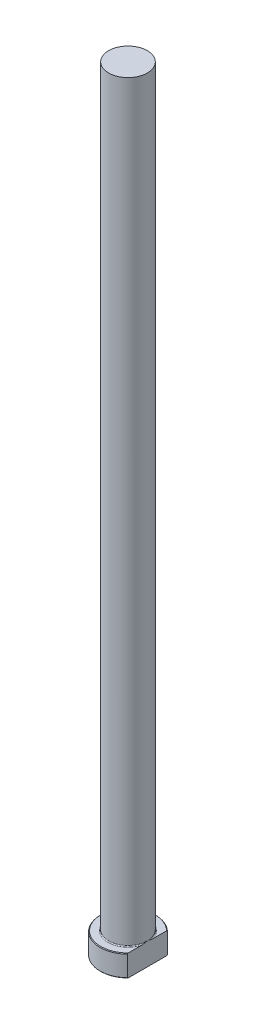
ISO-10303-21;
HEADER;
FILE_DESCRIPTION(('STEP AP214'),'2;1');
FILE_NAME('part.step','',(''),(''),'','','');
FILE_SCHEMA(('AUTOMOTIVE_DESIGN { 1 0 10303 214 1 1 1 1 }'));
ENDSEC;
DATA;
#1=APPLICATION_CONTEXT('core data for automotive mechanical design processes');
#2=APPLICATION_PROTOCOL_DEFINITION('international standard','automotive_design',2000,#1);
#3=PRODUCT_CONTEXT('',#1,'mechanical');
#4=PRODUCT('Part','Part','',(#3));
#5=PRODUCT_RELATED_PRODUCT_CATEGORY('part','',(#4));
#6=PRODUCT_DEFINITION_FORMATION('','',#4);
#7=PRODUCT_DEFINITION_CONTEXT('part definition',#1,'design');
#8=PRODUCT_DEFINITION('design','',#6,#7);
#9=PRODUCT_DEFINITION_SHAPE('','',#8);
#10=(LENGTH_UNIT() NAMED_UNIT(*) SI_UNIT(.MILLI.,.METRE.));
#11=(NAMED_UNIT(*) PLANE_ANGLE_UNIT() SI_UNIT($,.RADIAN.));
#12=(NAMED_UNIT(*) SI_UNIT($,.STERADIAN.) SOLID_ANGLE_UNIT());
#13=UNCERTAINTY_MEASURE_WITH_UNIT(LENGTH_MEASURE(1.E-05),#10,'distance_accuracy_value','');
#14=(GEOMETRIC_REPRESENTATION_CONTEXT(3) GLOBAL_UNCERTAINTY_ASSIGNED_CONTEXT((#13)) GLOBAL_UNIT_ASSIGNED_CONTEXT((#10,
#11,#12)) REPRESENTATION_CONTEXT('',''));
#15=CARTESIAN_POINT('',(0.,0.,0.));
#16=DIRECTION('',(0.,0.,1.));
#17=DIRECTION('',(1.,0.,0.));
#18=AXIS2_PLACEMENT_3D('',#15,#16,#17);
#19=CARTESIAN_POINT('',(0.,0.,0.));
#20=DIRECTION('',(0.,-1.,0.));
#21=DIRECTION('',(0.,0.,-1.));
#22=AXIS2_PLACEMENT_3D('',#19,#20,#21);
#23=PLANE('',#22);
#24=CARTESIAN_POINT('',(0.,0.,0.));
#25=DIRECTION('',(0.,-1.,0.));
#26=DIRECTION('',(0.,0.,-1.));
#27=AXIS2_PLACEMENT_3D('',#24,#25,#26);
#28=CIRCLE('',#27,8.79999999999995);
#29=CARTESIAN_POINT('',(6.24999999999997,0.,6.19495762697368));
#30=VERTEX_POINT('',#29);
#31=CARTESIAN_POINT('',(6.24999999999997,0.,-6.19495762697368));
#32=VERTEX_POINT('',#31);
#33=EDGE_CURVE('E98',#30,#32,#28,.T.);
#34=ORIENTED_EDGE('',*,*,#33,.T.);
#35=DIRECTION('',(0.,0.,1.));
#36=VECTOR('',#35,1.);
#37=CARTESIAN_POINT('',(6.24999999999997,0.,-6.47591692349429));
#38=LINE('',#37,#36);
#39=EDGE_CURVE('E83',#32,#30,#38,.T.);
#40=ORIENTED_EDGE('',*,*,#39,.T.);
#41=EDGE_LOOP('',(#34,#40));
#42=FACE_BOUND('',#41,.T.);
#43=ADVANCED_FACE('F32',(#42),#23,.T.);
#44=CARTESIAN_POINT('',(0.,259.958771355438,0.));
#45=DIRECTION('',(0.,1.,0.));
#46=DIRECTION('',(0.,0.,1.));
#47=AXIS2_PLACEMENT_3D('',#44,#45,#46);
#48=CYLINDRICAL_SURFACE('',#47,8.99999999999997);
#49=CARTESIAN_POINT('',(0.,6.79999999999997,0.));
#50=DIRECTION('',(0.,1.,0.));
#51=DIRECTION('',(0.,0.,1.));
#52=AXIS2_PLACEMENT_3D('',#49,#50,#51);
#53=CIRCLE('',#52,8.99999999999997);
#54=CARTESIAN_POINT('',(6.24999999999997,6.79999999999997,6.47591692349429));
#55=VERTEX_POINT('',#54);
#56=CARTESIAN_POINT('',(6.24999999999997,6.79999999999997,-6.47591692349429));
#57=VERTEX_POINT('',#56);
#58=EDGE_CURVE('E104',#55,#57,#53,.F.);
#59=ORIENTED_EDGE('',*,*,#58,.T.);
#60=DIRECTION('',(0.,-1.,0.));
#61=VECTOR('',#60,1.);
#62=CARTESIAN_POINT('',(6.24999999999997,250.,-6.47591692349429));
#63=LINE('',#62,#61);
#64=CARTESIAN_POINT('',(6.24999999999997,0.200000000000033,-6.47591692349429));
#65=VERTEX_POINT('',#64);
#66=EDGE_CURVE('E183',#57,#65,#63,.T.);
#67=ORIENTED_EDGE('',*,*,#66,.T.);
#68=CARTESIAN_POINT('',(0.,0.200000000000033,0.));
#69=DIRECTION('',(0.,-1.,0.));
#70=DIRECTION('',(0.,0.,-1.));
#71=AXIS2_PLACEMENT_3D('',#68,#69,#70);
#72=CIRCLE('',#71,8.99999999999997);
#73=CARTESIAN_POINT('',(6.24999999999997,0.200000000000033,6.47591692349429));
#74=VERTEX_POINT('',#73);
#75=EDGE_CURVE('E100',#65,#74,#72,.F.);
#76=ORIENTED_EDGE('',*,*,#75,.T.);
#77=DIRECTION('',(0.,-1.,0.));
#78=VECTOR('',#77,1.);
#79=CARTESIAN_POINT('',(6.24999999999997,250.,6.47591692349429));
#80=LINE('',#79,#78);
#81=EDGE_CURVE('E93',#55,#74,#80,.T.);
#82=ORIENTED_EDGE('',*,*,#81,.F.);
#83=EDGE_LOOP('',(#59,#67,#76,#82));
#84=FACE_BOUND('',#83,.T.);
#85=ADVANCED_FACE('F158',(#84),#48,.T.);
#86=CARTESIAN_POINT('',(-8.99999999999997,7.,0.));
#87=DIRECTION('',(0.,1.,0.));
#88=DIRECTION('',(0.,0.,1.));
#89=AXIS2_PLACEMENT_3D('',#86,#87,#88);
#90=PLANE('',#89);
#91=CARTESIAN_POINT('',(0.,7.,0.));
#92=DIRECTION('',(0.,1.,0.));
#93=DIRECTION('',(0.,0.,1.));
#94=AXIS2_PLACEMENT_3D('',#91,#92,#93);
#95=CIRCLE('',#94,8.79999999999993);
#96=CARTESIAN_POINT('',(6.24999999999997,7.,-6.19495762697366));
#97=VERTEX_POINT('',#96);
#98=CARTESIAN_POINT('',(6.24999999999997,7.,6.19495762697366));
#99=VERTEX_POINT('',#98);
#100=EDGE_CURVE('E178',#97,#99,#95,.T.);
#101=ORIENTED_EDGE('',*,*,#100,.T.);
#102=DIRECTION('',(0.,0.,-1.));
#103=VECTOR('',#102,1.);
#104=CARTESIAN_POINT('',(6.24999999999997,7.,0.));
#105=LINE('',#104,#103);
#106=CARTESIAN_POINT('',(6.24999999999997,6.99999999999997,1.95959179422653));
#107=VERTEX_POINT('',#106);
#108=EDGE_CURVE('E57',#99,#107,#105,.T.);
#109=ORIENTED_EDGE('',*,*,#108,.T.);
#110=CARTESIAN_POINT('',(0.,7.,0.));
#111=DIRECTION('',(0.,1.,0.));
#112=DIRECTION('',(0.,0.,1.));
#113=AXIS2_PLACEMENT_3D('',#110,#111,#112);
#114=CIRCLE('',#113,6.54999999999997);
#115=CARTESIAN_POINT('',(6.24999999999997,6.99999999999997,-1.95959179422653));
#116=VERTEX_POINT('',#115);
#117=EDGE_CURVE('E107',#107,#116,#114,.F.);
#118=ORIENTED_EDGE('',*,*,#117,.T.);
#119=EDGE_CURVE('E136',#116,#97,#105,.T.);
#120=ORIENTED_EDGE('',*,*,#119,.T.);
#121=EDGE_LOOP('',(#101,#109,#118,#120));
#122=FACE_BOUND('',#121,.T.);
#123=ADVANCED_FACE('F147',(#122),#90,.T.);
#124=CARTESIAN_POINT('',(0.,7.00000000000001,0.));
#125=DIRECTION('',(0.,-1.,0.));
#126=DIRECTION('',(0.,0.,-1.));
#127=AXIS2_PLACEMENT_3D('',#124,#125,#126);
#128=CONICAL_SURFACE('',#127,8.79999999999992,0.785398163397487);
#129=ORIENTED_EDGE('',*,*,#58,.F.);
#130=CARTESIAN_POINT('',(6.24999999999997,0.241333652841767,14.2481436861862));
#131=CARTESIAN_POINT('',(6.24999999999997,0.433510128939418,14.0382871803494));
#132=CARTESIAN_POINT('',(6.24999999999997,0.62531824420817,13.8280934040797));
#133=CARTESIAN_POINT('',(6.24999999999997,1.00808847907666,13.4069339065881));
#134=CARTESIAN_POINT('',(6.24999999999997,1.19905059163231,13.1959681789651));
#135=CARTESIAN_POINT('',(6.24999999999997,1.77058893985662,12.5616726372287));
#136=CARTESIAN_POINT('',(6.24999999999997,2.1497265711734,12.1370432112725));
#137=CARTESIAN_POINT('',(6.24999999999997,2.9054474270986,11.2804244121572));
#138=CARTESIAN_POINT('',(6.24999999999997,3.2819964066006,10.8484047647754));
#139=CARTESIAN_POINT('',(6.24999999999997,4.02800319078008,9.97835973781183));
#140=CARTESIAN_POINT('',(6.24999999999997,4.39746188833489,9.5403351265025));
#141=CARTESIAN_POINT('',(6.24999999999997,5.06619556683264,8.72902037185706));
#142=CARTESIAN_POINT('',(6.24999999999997,5.36698522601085,8.35698524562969));
#143=CARTESIAN_POINT('',(6.24999999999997,5.81091107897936,7.79312105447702));
#144=CARTESIAN_POINT('',(6.24999999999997,5.95769918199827,7.60416746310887));
#145=CARTESIAN_POINT('',(6.24999999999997,6.24834991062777,7.22402635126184));
#146=CARTESIAN_POINT('',(6.24999999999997,6.392212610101,7.03283888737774));
#147=CARTESIAN_POINT('',(6.24999999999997,6.67624882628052,6.64809388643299));
#148=CARTESIAN_POINT('',(6.24999999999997,6.81642658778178,6.45453948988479));
#149=CARTESIAN_POINT('',(6.24999999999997,7.09250069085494,6.06440831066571));
#150=CARTESIAN_POINT('',(6.24999999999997,7.2283972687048,5.86783169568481));
#151=CARTESIAN_POINT('',(6.24999999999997,7.49487226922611,5.47121725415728));
#152=CARTESIAN_POINT('',(6.24999999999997,7.62545297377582,5.27118096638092));
#153=CARTESIAN_POINT('',(6.24999999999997,7.88005759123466,4.86699392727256));
#154=CARTESIAN_POINT('',(6.24999999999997,8.00408234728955,4.66284370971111));
#155=CARTESIAN_POINT('',(6.24999999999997,8.24192682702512,4.25315549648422));
#156=CARTESIAN_POINT('',(6.24999999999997,8.35588135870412,4.04769623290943));
#157=CARTESIAN_POINT('',(6.24999999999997,8.57376120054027,3.63145654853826));
#158=CARTESIAN_POINT('',(6.24999999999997,8.67768550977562,3.42067559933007));
#159=CARTESIAN_POINT('',(6.24999999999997,8.87268822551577,2.99352725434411));
#160=CARTESIAN_POINT('',(6.24999999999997,8.96378316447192,2.77716748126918));
#161=CARTESIAN_POINT('',(6.24999999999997,9.12997532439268,2.33835397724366));
#162=CARTESIAN_POINT('',(6.24999999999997,9.20507709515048,2.11590199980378));
#163=CARTESIAN_POINT('',(6.24999999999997,9.32245998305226,1.71047588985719));
#164=CARTESIAN_POINT('',(6.24999999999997,9.36830307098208,1.52853906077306));
#165=CARTESIAN_POINT('',(6.24999999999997,9.44550018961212,1.16159607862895));
#166=CARTESIAN_POINT('',(6.24999999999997,9.47685624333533,0.976590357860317));
#167=CARTESIAN_POINT('',(6.24999999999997,9.52348341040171,0.605004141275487));
#168=CARTESIAN_POINT('',(6.24999999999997,9.53879458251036,0.418428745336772));
#169=CARTESIAN_POINT('',(6.24999999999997,9.55263073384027,0.0446485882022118));
#170=CARTESIAN_POINT('',(6.24999999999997,9.55115595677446,-0.142556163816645));
#171=CARTESIAN_POINT('',(6.24999999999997,9.53151010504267,-0.515964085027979));
#172=CARTESIAN_POINT('',(6.24999999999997,9.51334871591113,-0.702167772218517));
#173=CARTESIAN_POINT('',(6.24999999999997,9.46132296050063,-1.07235055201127));
#174=CARTESIAN_POINT('',(6.24999999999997,9.42745724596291,-1.2563294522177));
#175=CARTESIAN_POINT('',(6.24999999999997,9.34551825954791,-1.62161387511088));
#176=CARTESIAN_POINT('',(6.24999999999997,9.29740414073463,-1.80291011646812));
#177=CARTESIAN_POINT('',(6.24999999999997,9.18891949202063,-2.16174722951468));
#178=CARTESIAN_POINT('',(6.24999999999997,9.12854919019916,-2.3392881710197));
#179=CARTESIAN_POINT('',(6.24999999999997,8.98038960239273,-2.73619642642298));
#180=CARTESIAN_POINT('',(6.24999999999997,8.88955370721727,-2.95442044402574));
#181=CARTESIAN_POINT('',(6.24999999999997,8.69480317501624,-3.38500003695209));
#182=CARTESIAN_POINT('',(6.24999999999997,8.59088203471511,-3.59735262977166));
#183=CARTESIAN_POINT('',(6.24999999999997,8.37253952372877,-4.01706977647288));
#184=CARTESIAN_POINT('',(6.24999999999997,8.2580982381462,-4.22442389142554));
#185=CARTESIAN_POINT('',(6.24999999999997,8.02107167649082,-4.63434772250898));
#186=CARTESIAN_POINT('',(6.24999999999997,7.89848770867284,-4.83691820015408));
#187=CARTESIAN_POINT('',(6.24999999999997,7.64548625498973,-5.24008406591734));
#188=CARTESIAN_POINT('',(6.24999999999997,7.51499955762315,-5.44063581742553));
#189=CARTESIAN_POINT('',(6.24999999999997,7.24868510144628,-5.83817237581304));
#190=CARTESIAN_POINT('',(6.24999999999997,7.11285688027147,-6.03515687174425));
#191=CARTESIAN_POINT('',(6.24999999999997,6.83683288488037,-6.42612120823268));
#192=CARTESIAN_POINT('',(6.24999999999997,6.69663581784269,-6.62010013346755));
#193=CARTESIAN_POINT('',(6.24999999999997,6.41268260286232,-7.00543858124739));
#194=CARTESIAN_POINT('',(6.24999999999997,6.26892633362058,-7.19679801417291));
#195=CARTESIAN_POINT('',(6.24999999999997,5.89056224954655,-7.6924294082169));
#196=CARTESIAN_POINT('',(6.24999999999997,5.65363599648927,-7.99493062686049));
#197=CARTESIAN_POINT('',(6.24999999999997,5.17412949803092,-8.59529922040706));
#198=CARTESIAN_POINT('',(6.24999999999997,4.9315503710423,-8.89316749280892));
#199=CARTESIAN_POINT('',(6.24999999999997,4.44181409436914,-9.48544309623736));
#200=CARTESIAN_POINT('',(6.24999999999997,4.19465400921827,-9.77984799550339));
#201=CARTESIAN_POINT('',(6.24999999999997,3.6968379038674,-10.3657062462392));
#202=CARTESIAN_POINT('',(6.24999999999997,3.44618171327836,-10.6571594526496));
#203=CARTESIAN_POINT('',(6.24999999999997,2.95199448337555,-11.2262122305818));
#204=CARTESIAN_POINT('',(6.24999999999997,2.70857128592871,-11.5039055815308));
#205=CARTESIAN_POINT('',(6.24999999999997,2.21961081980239,-12.0574158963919));
#206=CARTESIAN_POINT('',(6.24999999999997,1.97407358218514,-12.3332328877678));
#207=CARTESIAN_POINT('',(6.24999999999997,1.4815097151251,-12.8829958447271));
#208=CARTESIAN_POINT('',(6.24999999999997,1.23448497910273,-13.1569435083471));
#209=CARTESIAN_POINT('',(6.24999999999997,0.738953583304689,-13.7034947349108));
#210=CARTESIAN_POINT('',(6.24999999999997,0.490446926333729,-13.9760983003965));
#211=CARTESIAN_POINT('',(6.24999999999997,0.241333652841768,-14.2481436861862));
#212=B_SPLINE_CURVE_WITH_KNOTS('',3,(#130,#131,#132,#133,#134,#135,#136,#137,#138,#139,#140,
#141,#142,#143,#144,#145,#146,#147,#148,#149,#150,#151,#152,#153,#154,#155,#156,#157,#158,#159,
#160,#161,#162,#163,#164,#165,#166,#167,#168,#169,#170,#171,#172,#173,#174,#175,#176,#177,#178,
#179,#180,#181,#182,#183,#184,#185,#186,#187,#188,#189,#190,#191,#192,#193,#194,#195,#196,#197,
#198,#199,#200,#201,#202,#203,#204,#205,#206,#207,#208,#209,#210,#211),.UNSPECIFIED.,.F.,.F.,(4,
2,2,2,2,2,2,2,2,2,2,2,2,2,2,2,2,2,2,2,2,2,2,2,2,2,2,2,2,2,2,2,2,2,2,2,2,2,2,2,4),(0.,
0.853664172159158,1.70733543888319,3.41508002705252,5.13429133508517,6.85328470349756,
8.28840776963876,9.00619588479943,9.72396585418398,10.4408691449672,11.1577328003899,
11.8742854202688,12.5907456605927,13.2953619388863,14.0000484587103,14.7038184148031,
15.4073878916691,15.9697505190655,16.5320345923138,17.0929114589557,17.6537801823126,
18.2143235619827,18.7749150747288,19.3371294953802,19.8993334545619,20.6078926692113,
21.3168054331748,22.0270889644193,22.7372586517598,23.4549493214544,24.1727022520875,
24.8906696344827,25.608661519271,26.7612833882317,27.9136791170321,29.0668407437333,
30.220058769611,31.3278889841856,32.4357029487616,33.5423213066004,34.6489375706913),.UNSPECIFIED.);
#213=EDGE_CURVE('E135',#55,#99,#212,.T.);
#214=ORIENTED_EDGE('',*,*,#213,.T.);
#215=ORIENTED_EDGE('',*,*,#100,.F.);
#216=EDGE_CURVE('E127',#97,#57,#212,.T.);
#217=ORIENTED_EDGE('',*,*,#216,.T.);
#218=EDGE_LOOP('',(#129,#214,#215,#217));
#219=FACE_BOUND('',#218,.T.);
#220=ADVANCED_FACE('F143',(#219),#128,.T.);
#221=CARTESIAN_POINT('',(0.,0.200000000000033,0.));
#222=DIRECTION('',(0.,1.,0.));
#223=DIRECTION('',(0.,0.,1.));
#224=AXIS2_PLACEMENT_3D('',#221,#222,#223);
#225=CONICAL_SURFACE('',#224,8.99999999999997,0.785398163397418);
#226=ORIENTED_EDGE('',*,*,#75,.F.);
#227=CARTESIAN_POINT('',(6.24999999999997,6.75866634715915,-14.2481436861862));
#228=CARTESIAN_POINT('',(6.24999999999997,6.56648987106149,-14.0382871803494));
#229=CARTESIAN_POINT('',(6.24999999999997,6.37468175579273,-13.8280934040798));
#230=CARTESIAN_POINT('',(6.24999999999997,5.99191152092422,-13.4069339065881));
#231=CARTESIAN_POINT('',(6.24999999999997,5.80094940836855,-13.1959681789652));
#232=CARTESIAN_POINT('',(6.24999999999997,5.22941106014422,-12.5616726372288));
#233=CARTESIAN_POINT('',(6.24999999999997,4.85027342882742,-12.1370432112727));
#234=CARTESIAN_POINT('',(6.24999999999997,4.09455257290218,-11.2804244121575));
#235=CARTESIAN_POINT('',(6.24999999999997,3.71800359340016,-10.8484047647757));
#236=CARTESIAN_POINT('',(6.24999999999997,2.97199680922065,-9.97835973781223));
#237=CARTESIAN_POINT('',(6.24999999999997,2.60253811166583,-9.54033512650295));
#238=CARTESIAN_POINT('',(6.24999999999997,1.93380443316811,-8.72902037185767));
#239=CARTESIAN_POINT('',(6.24999999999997,1.63301477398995,-8.35698524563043));
#240=CARTESIAN_POINT('',(6.24999999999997,1.18908892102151,-7.79312105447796));
#241=CARTESIAN_POINT('',(6.24999999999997,1.04230081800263,-7.60416746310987));
#242=CARTESIAN_POINT('',(6.24999999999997,0.751650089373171,-7.22402635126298));
#243=CARTESIAN_POINT('',(6.24999999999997,0.607787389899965,-7.03283888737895));
#244=CARTESIAN_POINT('',(6.24999999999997,0.323751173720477,-6.64809388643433));
#245=CARTESIAN_POINT('',(6.24999999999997,0.183573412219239,-6.4545394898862));
#246=CARTESIAN_POINT('',(6.24999999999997,-0.0925006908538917,-6.06440831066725));
#247=CARTESIAN_POINT('',(6.24999999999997,-0.228397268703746,-5.86783169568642));
#248=CARTESIAN_POINT('',(6.24999999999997,-0.494872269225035,-5.47121725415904));
#249=CARTESIAN_POINT('',(6.24999999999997,-0.62545297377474,-5.27118096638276));
#250=CARTESIAN_POINT('',(6.24999999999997,-0.880057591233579,-4.86699392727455));
#251=CARTESIAN_POINT('',(6.24999999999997,-1.00408234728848,-4.66284370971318));
#252=CARTESIAN_POINT('',(6.24999999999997,-1.24192682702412,-4.25315549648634));
#253=CARTESIAN_POINT('',(6.24999999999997,-1.35588135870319,-4.04769623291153));
#254=CARTESIAN_POINT('',(6.24999999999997,-1.57376120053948,-3.63145654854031));
#255=CARTESIAN_POINT('',(6.24999999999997,-1.67768550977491,-3.42067559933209));
#256=CARTESIAN_POINT('',(6.24999999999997,-1.8726882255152,-2.99352725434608));
#257=CARTESIAN_POINT('',(6.24999999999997,-1.96378316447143,-2.77716748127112));
#258=CARTESIAN_POINT('',(6.24999999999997,-2.12997532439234,-2.33835397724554));
#259=CARTESIAN_POINT('',(6.24999999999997,-2.20507709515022,-2.11590199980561));
#260=CARTESIAN_POINT('',(6.24999999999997,-2.32245998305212,-1.71047588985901));
#261=CARTESIAN_POINT('',(6.24999999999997,-2.36830307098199,-1.5285390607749));
#262=CARTESIAN_POINT('',(6.24999999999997,-2.44550018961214,-1.16159607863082));
#263=CARTESIAN_POINT('',(6.24999999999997,-2.47685624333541,-0.976590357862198));
#264=CARTESIAN_POINT('',(6.24999999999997,-2.5234834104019,-0.605004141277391));
#265=CARTESIAN_POINT('',(6.24999999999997,-2.5387945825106,-0.418428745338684));
#266=CARTESIAN_POINT('',(6.24999999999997,-2.55263073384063,-0.0446485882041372));
#267=CARTESIAN_POINT('',(6.24999999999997,-2.55115595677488,0.142556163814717));
#268=CARTESIAN_POINT('',(6.24999999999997,-2.53151010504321,0.515964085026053));
#269=CARTESIAN_POINT('',(6.24999999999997,-2.51334871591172,0.702167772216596));
#270=CARTESIAN_POINT('',(6.24999999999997,-2.46132296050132,1.07235055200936));
#271=CARTESIAN_POINT('',(6.24999999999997,-2.42745724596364,1.2563294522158));
#272=CARTESIAN_POINT('',(6.24999999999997,-2.34551825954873,1.621613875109));
#273=CARTESIAN_POINT('',(6.24999999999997,-2.29740414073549,1.80291011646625));
#274=CARTESIAN_POINT('',(6.24999999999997,-2.18891949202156,2.16174722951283));
#275=CARTESIAN_POINT('',(6.24999999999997,-2.12854919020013,2.33928817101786));
#276=CARTESIAN_POINT('',(6.24999999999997,-1.98038960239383,2.73619642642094));
#277=CARTESIAN_POINT('',(6.24999999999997,-1.8895537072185,2.9544204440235));
#278=CARTESIAN_POINT('',(6.24999999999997,-1.69480317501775,3.38500003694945));
#279=CARTESIAN_POINT('',(6.24999999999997,-1.59088203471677,3.59735262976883));
#280=CARTESIAN_POINT('',(6.24999999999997,-1.37253952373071,4.01706977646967));
#281=CARTESIAN_POINT('',(6.24999999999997,-1.2580982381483,4.22442389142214));
#282=CARTESIAN_POINT('',(6.24999999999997,-1.02107167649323,4.6343477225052));
#283=CARTESIAN_POINT('',(6.24999999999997,-0.898487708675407,4.83691820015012));
#284=CARTESIAN_POINT('',(6.24999999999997,-0.645486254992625,5.24008406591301));
#285=CARTESIAN_POINT('',(6.24999999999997,-0.514999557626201,5.44063581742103));
#286=CARTESIAN_POINT('',(6.24999999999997,-0.248685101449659,5.83817237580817));
#287=CARTESIAN_POINT('',(6.24999999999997,-0.112856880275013,6.03515687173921));
#288=CARTESIAN_POINT('',(6.24999999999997,0.163167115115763,6.42612120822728));
#289=CARTESIAN_POINT('',(6.24999999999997,0.303364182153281,6.62010013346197));
#290=CARTESIAN_POINT('',(6.24999999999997,0.587317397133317,7.00543858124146));
#291=CARTESIAN_POINT('',(6.24999999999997,0.731073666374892,7.19679801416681));
#292=CARTESIAN_POINT('',(6.24999999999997,1.10943775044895,7.69242940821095));
#293=CARTESIAN_POINT('',(6.24999999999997,1.34636400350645,7.99493062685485));
#294=CARTESIAN_POINT('',(6.24999999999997,1.82587050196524,8.59529922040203));
#295=CARTESIAN_POINT('',(6.24999999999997,2.06844962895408,8.89316749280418));
#296=CARTESIAN_POINT('',(6.24999999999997,2.55818590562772,9.4854430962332));
#297=CARTESIAN_POINT('',(6.24999999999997,2.80534599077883,9.77984799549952));
#298=CARTESIAN_POINT('',(6.24999999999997,3.3031620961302,10.3657062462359));
#299=CARTESIAN_POINT('',(6.24999999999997,3.55381828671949,10.6571594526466));
#300=CARTESIAN_POINT('',(6.24999999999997,4.04800551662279,11.2262122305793));
#301=CARTESIAN_POINT('',(6.24999999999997,4.29142871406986,11.5039055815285));
#302=CARTESIAN_POINT('',(6.24999999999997,4.78038918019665,12.0574158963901));
#303=CARTESIAN_POINT('',(6.24999999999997,5.02592641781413,12.3332328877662));
#304=CARTESIAN_POINT('',(6.24999999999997,5.51849028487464,12.882995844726));
#305=CARTESIAN_POINT('',(6.24999999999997,5.76551502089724,13.1569435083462));
#306=CARTESIAN_POINT('',(6.24999999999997,6.26104641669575,13.7034947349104));
#307=CARTESIAN_POINT('',(6.24999999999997,6.50955307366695,13.9760983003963));
#308=CARTESIAN_POINT('',(6.24999999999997,6.75866634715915,14.2481436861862));
#309=B_SPLINE_CURVE_WITH_KNOTS('',3,(#227,#228,#229,#230,#231,#232,#233,#234,#235,#236,#237,
#238,#239,#240,#241,#242,#243,#244,#245,#246,#247,#248,#249,#250,#251,#252,#253,#254,#255,#256,
#257,#258,#259,#260,#261,#262,#263,#264,#265,#266,#267,#268,#269,#270,#271,#272,#273,#274,#275,
#276,#277,#278,#279,#280,#281,#282,#283,#284,#285,#286,#287,#288,#289,#290,#291,#292,#293,#294,
#295,#296,#297,#298,#299,#300,#301,#302,#303,#304,#305,#306,#307,#308),.UNSPECIFIED.,.F.,.F.,(4,
2,2,2,2,2,2,2,2,2,2,2,2,2,2,2,2,2,2,2,2,2,2,2,2,2,2,2,2,2,2,2,2,2,2,2,2,2,2,2,4),(0.,
0.853664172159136,1.70733543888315,3.41508002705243,5.13429133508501,6.85328470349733,
8.28840776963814,9.00619588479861,9.72396585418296,10.440869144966,11.1577328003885,
11.8742854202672,12.5907456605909,13.2953619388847,14.0000484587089,14.7038184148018,
15.407387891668,15.9697505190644,16.5320345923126,17.0929114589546,17.6537801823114,
18.2143235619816,18.7749150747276,19.3371294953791,19.8993334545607,20.6078926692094,
21.3168054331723,22.027088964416,22.7372586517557,23.4549493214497,24.172702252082,
24.8906696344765,25.6086615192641,26.7612833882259,27.9136791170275,29.0668407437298,
30.2200587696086,31.3278889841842,32.4357029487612,33.5423213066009,34.6489375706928),.UNSPECIFIED.);
#310=EDGE_CURVE('E86',#65,#32,#309,.T.);
#311=ORIENTED_EDGE('',*,*,#310,.T.);
#312=ORIENTED_EDGE('',*,*,#33,.F.);
#313=EDGE_CURVE('E89',#30,#74,#309,.T.);
#314=ORIENTED_EDGE('',*,*,#313,.T.);
#315=EDGE_LOOP('',(#226,#311,#312,#314));
#316=FACE_BOUND('',#315,.T.);
#317=ADVANCED_FACE('F97',(#316),#225,.T.);
#318=CARTESIAN_POINT('',(0.,7.29999999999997,0.));
#319=DIRECTION('',(0.,1.,0.));
#320=DIRECTION('',(0.,0.,1.));
#321=AXIS2_PLACEMENT_3D('',#318,#319,#320);
#322=TOROIDAL_SURFACE('',#321,6.54999999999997,0.3);
#323=CARTESIAN_POINT('',(6.24999999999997,7.29999999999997,0.));
#324=CARTESIAN_POINT('',(6.24999999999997,7.30000062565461,1.07935811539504E-10));
#325=CARTESIAN_POINT('',(6.24999999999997,7.30000125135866,-2.93503388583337E-07));
#326=CARTESIAN_POINT('',(6.24999999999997,7.300002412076,-1.07409020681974E-06));
#327=CARTESIAN_POINT('',(6.24999999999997,7.30000292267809,-1.58214987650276E-06));
#328=CARTESIAN_POINT('',(6.24999999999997,7.30000400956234,-2.8081901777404E-06));
#329=CARTESIAN_POINT('',(6.24999999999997,7.30000456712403,-3.54604295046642E-06));
#330=CARTESIAN_POINT('',(6.24999999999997,7.30000554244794,-5.05412397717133E-06));
#331=CARTESIAN_POINT('',(6.24999999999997,7.30000596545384,-5.82130991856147E-06));
#332=CARTESIAN_POINT('',(6.24999999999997,7.30000759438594,-8.87270548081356E-06));
#333=CARTESIAN_POINT('',(6.24999999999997,7.30000872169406,-1.1203275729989E-05));
#334=CARTESIAN_POINT('',(6.24999999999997,7.30001051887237,-1.57552363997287E-05));
#335=CARTESIAN_POINT('',(6.24999999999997,7.30001122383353,-1.79632548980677E-05));
#336=CARTESIAN_POINT('',(6.24999999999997,7.30001427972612,-2.752581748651E-05));
#337=CARTESIAN_POINT('',(6.24999999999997,7.30001663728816,-3.48805238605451E-05));
#338=CARTESIAN_POINT('',(6.24999999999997,7.30002001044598,-4.8619148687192E-05));
#339=CARTESIAN_POINT('',(6.24999999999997,7.30002118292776,-5.49639235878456E-05));
#340=CARTESIAN_POINT('',(6.24999999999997,7.30002986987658,-0.000102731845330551));
#341=CARTESIAN_POINT('',(6.24999999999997,7.30003662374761,-0.000144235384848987));
#342=CARTESIAN_POINT('',(6.24999999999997,7.30006617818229,-0.000309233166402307));
#343=CARTESIAN_POINT('',(6.24999999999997,7.3000942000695,-0.000431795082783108));
#344=CARTESIAN_POINT('',(6.24999999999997,7.30020410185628,-0.000919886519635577));
#345=CARTESIAN_POINT('',(6.24999999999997,7.3002827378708,-0.00128589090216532));
#346=CARTESIAN_POINT('',(6.24999999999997,7.30059929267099,-0.00274922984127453));
#347=CARTESIAN_POINT('',(6.24999999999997,7.30084138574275,-0.00384592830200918));
#348=CARTESIAN_POINT('',(6.24999999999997,7.30185366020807,-0.00844291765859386));
#349=CARTESIAN_POINT('',(6.24999999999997,7.30261854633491,-0.0119440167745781));
#350=CARTESIAN_POINT('',(6.24999999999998,7.30934535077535,-0.0427197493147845));
#351=CARTESIAN_POINT('',(6.24999999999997,7.31532845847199,-0.0699912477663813));
#352=CARTESIAN_POINT('',(6.24999999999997,7.32701994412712,-0.1234289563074));
#353=CARTESIAN_POINT('',(6.24999999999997,7.33272958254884,-0.14959492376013));
#354=CARTESIAN_POINT('',(6.24999999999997,7.34485779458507,-0.205323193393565));
#355=CARTESIAN_POINT('',(6.24999999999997,7.35127239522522,-0.23488638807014));
#356=CARTESIAN_POINT('',(6.24999999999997,7.36411066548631,-0.294356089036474));
#357=CARTESIAN_POINT('',(6.24999999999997,7.37053363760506,-0.324262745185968));
#358=CARTESIAN_POINT('',(6.24999999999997,7.38584616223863,-0.396051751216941));
#359=CARTESIAN_POINT('',(6.24999999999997,7.39469543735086,-0.437942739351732));
#360=CARTESIAN_POINT('',(6.24999999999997,7.41192932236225,-0.520630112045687));
#361=CARTESIAN_POINT('',(6.24999999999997,7.42032002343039,-0.561425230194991));
#362=CARTESIAN_POINT('',(6.24999999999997,7.44742205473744,-0.69545636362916));
#363=CARTESIAN_POINT('',(6.24999999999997,7.4655604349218,-0.788810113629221));
#364=CARTESIAN_POINT('',(6.24999999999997,7.49982037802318,-0.976827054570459));
#365=CARTESIAN_POINT('',(6.24999999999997,7.51592073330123,-1.07149417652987));
#366=CARTESIAN_POINT('',(6.24999999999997,7.54633300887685,-1.27034734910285));
#367=CARTESIAN_POINT('',(6.24999999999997,7.56032934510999,-1.37458266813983));
#368=CARTESIAN_POINT('',(6.24999999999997,7.58288660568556,-1.58337219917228));
#369=CARTESIAN_POINT('',(6.24999999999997,7.59146383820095,-1.68792449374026));
#370=CARTESIAN_POINT('',(6.24999999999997,7.59839530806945,-1.84328437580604));
#371=CARTESIAN_POINT('',(6.24999999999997,7.59974160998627,-1.89395725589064));
#372=CARTESIAN_POINT('',(6.24999999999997,7.60019235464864,-1.99536854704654));
#373=CARTESIAN_POINT('',(6.24999999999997,7.59929473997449,-2.04610697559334));
#374=CARTESIAN_POINT('',(6.24999999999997,7.59472992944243,-2.14676570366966));
#375=CARTESIAN_POINT('',(6.24999999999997,7.5911010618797,-2.19668764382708));
#376=CARTESIAN_POINT('',(6.24999999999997,7.58034281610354,-2.29612823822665));
#377=CARTESIAN_POINT('',(6.24999999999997,7.57321785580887,-2.3456473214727));
#378=CARTESIAN_POINT('',(6.24999999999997,7.55883861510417,-2.41968621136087));
#379=CARTESIAN_POINT('',(6.24999999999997,7.55336305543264,-2.44455073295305));
#380=CARTESIAN_POINT('',(6.24999999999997,7.54088765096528,-2.49388968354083));
#381=CARTESIAN_POINT('',(6.24999999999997,7.53388865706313,-2.51836432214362));
#382=CARTESIAN_POINT('',(6.24999999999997,7.5180160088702,-2.56658659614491));
#383=CARTESIAN_POINT('',(6.24999999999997,7.50915079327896,-2.59033697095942));
#384=CARTESIAN_POINT('',(6.24999999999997,7.48896575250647,-2.63675110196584));
#385=CARTESIAN_POINT('',(6.24999999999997,7.47765263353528,-2.65941762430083));
#386=CARTESIAN_POINT('',(6.24999999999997,7.45696632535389,-2.69385500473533));
#387=CARTESIAN_POINT('',(6.24999999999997,7.4486983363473,-2.70628406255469));
#388=CARTESIAN_POINT('',(6.24999999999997,7.43069170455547,-2.73004308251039));
#389=CARTESIAN_POINT('',(6.24999999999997,7.42095514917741,-2.74137456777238));
#390=CARTESIAN_POINT('',(6.24999999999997,7.40313125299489,-2.75886410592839));
#391=CARTESIAN_POINT('',(6.24999999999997,7.39552792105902,-2.76551055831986));
#392=CARTESIAN_POINT('',(6.24999999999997,7.37942171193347,-2.77761940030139));
#393=CARTESIAN_POINT('',(6.24999999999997,7.37092027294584,-2.78308364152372));
#394=CARTESIAN_POINT('',(6.24999999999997,7.3552039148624,-2.79123019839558));
#395=CARTESIAN_POINT('',(6.24999999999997,7.34817405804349,-2.79426565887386));
#396=CARTESIAN_POINT('',(6.24999999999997,7.33371058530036,-2.79914227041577));
#397=CARTESIAN_POINT('',(6.24999999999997,7.32627746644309,-2.80098485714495));
#398=CARTESIAN_POINT('',(6.24999999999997,7.31114486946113,-2.80329865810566));
#399=CARTESIAN_POINT('',(6.24999999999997,7.30344395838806,-2.8037607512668));
#400=CARTESIAN_POINT('',(6.24999999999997,7.28809169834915,-2.80323167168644));
#401=CARTESIAN_POINT('',(6.24999999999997,7.28044035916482,-2.8022402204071));
#402=CARTESIAN_POINT('',(6.24999999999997,7.26612892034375,-2.79907216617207));
#403=CARTESIAN_POINT('',(6.24999999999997,7.25944213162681,-2.79701213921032));
#404=CARTESIAN_POINT('',(6.24999999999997,7.24643877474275,-2.79195274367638));
#405=CARTESIAN_POINT('',(6.24999999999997,7.24012234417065,-2.78895302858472));
#406=CARTESIAN_POINT('',(6.24999999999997,7.2241404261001,-2.78010234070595));
#407=CARTESIAN_POINT('',(6.24999999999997,7.21481747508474,-2.77363492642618));
#408=CARTESIAN_POINT('',(6.24999999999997,7.19727307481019,-2.75934472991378));
#409=CARTESIAN_POINT('',(6.24999999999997,7.18905534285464,-2.75151756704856));
#410=CARTESIAN_POINT('',(6.24999999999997,7.16746274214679,-2.72838666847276));
#411=CARTESIAN_POINT('',(6.24999999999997,7.15517318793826,-2.71208063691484));
#412=CARTESIAN_POINT('',(6.24999999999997,7.13297830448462,-2.67797126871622));
#413=CARTESIAN_POINT('',(6.24999999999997,7.12307686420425,-2.66016555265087));
#414=CARTESIAN_POINT('',(6.24999999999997,7.10185271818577,-2.61712561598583));
#415=CARTESIAN_POINT('',(6.24999999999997,7.09129494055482,-2.59151849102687));
#416=CARTESIAN_POINT('',(6.24999999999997,7.07260379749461,-2.53941658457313));
#417=CARTESIAN_POINT('',(6.24999999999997,7.06447530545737,-2.51292013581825));
#418=CARTESIAN_POINT('',(6.24999999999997,7.05002040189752,-2.45908915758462));
#419=CARTESIAN_POINT('',(6.24999999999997,7.04371803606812,-2.43174827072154));
#420=CARTESIAN_POINT('',(6.24999999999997,7.03267951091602,-2.37679196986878));
#421=CARTESIAN_POINT('',(6.24999999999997,7.0279416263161,-2.34917689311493));
#422=CARTESIAN_POINT('',(6.24999999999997,7.01732549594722,-2.27736486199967));
#423=CARTESIAN_POINT('',(6.24999999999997,7.01243082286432,-2.23302306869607));
#424=CARTESIAN_POINT('',(6.24999999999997,7.00516057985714,-2.1441265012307));
#425=CARTESIAN_POINT('',(6.24999999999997,7.00278642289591,-2.099571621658));
#426=CARTESIAN_POINT('',(6.24999999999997,6.99868217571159,-1.96551117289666));
#427=CARTESIAN_POINT('',(6.24999999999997,7.0000072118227,-1.87591316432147));
#428=CARTESIAN_POINT('',(6.24999999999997,7.0080292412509,-1.70248618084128));
#429=CARTESIAN_POINT('',(6.24999999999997,7.01439439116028,-1.61863796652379));
#430=CARTESIAN_POINT('',(6.24999999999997,7.03083822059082,-1.45127006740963));
#431=CARTESIAN_POINT('',(6.24999999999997,7.04091883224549,-1.3677505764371));
#432=CARTESIAN_POINT('',(6.24999999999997,7.06480380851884,-1.19431308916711));
#433=CARTESIAN_POINT('',(6.24999999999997,7.07884475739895,-1.10442856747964));
#434=CARTESIAN_POINT('',(6.24999999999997,7.10969415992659,-0.922729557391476));
#435=CARTESIAN_POINT('',(6.24999999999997,7.12656524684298,-0.830925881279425));
#436=CARTESIAN_POINT('',(6.24999999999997,7.15670076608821,-0.67515179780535));
#437=CARTESIAN_POINT('',(6.24999999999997,7.16952837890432,-0.611095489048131));
#438=CARTESIAN_POINT('',(6.24999999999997,7.19564112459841,-0.483838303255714));
#439=CARTESIAN_POINT('',(6.24999999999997,7.2089193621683,-0.420636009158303));
#440=CARTESIAN_POINT('',(6.24999999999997,7.23428285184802,-0.301644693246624));
#441=CARTESIAN_POINT('',(6.24999999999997,7.24632762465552,-0.245846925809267));
#442=CARTESIAN_POINT('',(6.24999999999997,7.27113004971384,-0.131848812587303));
#443=CARTESIAN_POINT('',(6.24999999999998,7.28389583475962,-0.0736501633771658));
#444=CARTESIAN_POINT('',(6.24999999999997,7.29738281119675,-0.0119373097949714));
#445=CARTESIAN_POINT('',(6.24999999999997,7.29814924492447,-0.00842953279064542));
#446=CARTESIAN_POINT('',(6.24999999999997,7.2991618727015,-0.00383105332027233));
#447=CARTESIAN_POINT('',(6.24999999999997,7.29940281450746,-0.00273954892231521));
#448=CARTESIAN_POINT('',(6.24999999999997,7.29971797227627,-0.00128266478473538));
#449=CARTESIAN_POINT('',(6.24999999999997,7.29979633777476,-0.000917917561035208));
#450=CARTESIAN_POINT('',(6.24999999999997,7.29990591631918,-0.000431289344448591));
#451=CARTESIAN_POINT('',(6.24999999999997,7.29993389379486,-0.000308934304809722));
#452=CARTESIAN_POINT('',(6.24999999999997,7.29996340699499,-0.00014417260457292));
#453=CARTESIAN_POINT('',(6.24999999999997,7.29997015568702,-0.000102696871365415));
#454=CARTESIAN_POINT('',(6.24999999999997,7.29997883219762,-5.49575231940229E-05));
#455=CARTESIAN_POINT('',(6.24999999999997,7.29998000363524,-4.86141750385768E-05));
#456=CARTESIAN_POINT('',(6.24999999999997,7.29998337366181,-3.48785875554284E-05));
#457=CARTESIAN_POINT('',(6.24999999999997,7.29998572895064,-2.75254181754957E-05));
#458=CARTESIAN_POINT('',(6.24999999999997,7.29998878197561,-1.79644811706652E-05));
#459=CARTESIAN_POINT('',(6.24999999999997,7.29998948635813,-1.57565691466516E-05));
#460=CARTESIAN_POINT('',(6.24999999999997,7.29999128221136,-1.12047374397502E-05));
#461=CARTESIAN_POINT('',(6.24999999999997,7.29999240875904,-8.87417477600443E-06));
#462=CARTESIAN_POINT('',(6.24999999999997,7.29999403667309,-5.82269238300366E-06));
#463=CARTESIAN_POINT('',(6.24999999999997,7.29999445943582,-5.05545097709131E-06));
#464=CARTESIAN_POINT('',(6.24999999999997,7.29999543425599,-3.54721514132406E-06));
#465=CARTESIAN_POINT('',(6.24999999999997,7.29999599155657,-2.80926073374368E-06));
#466=CARTESIAN_POINT('',(6.24999999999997,7.29999707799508,-1.58298694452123E-06));
#467=CARTESIAN_POINT('',(6.24999999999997,7.29999758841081,-1.07480544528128E-06));
#468=CARTESIAN_POINT('',(6.24999999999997,7.29999874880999,-2.93902319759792E-07));
#469=CARTESIAN_POINT('',(6.24999999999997,7.29999937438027,-1.07929784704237E-10));
#470=CARTESIAN_POINT('',(6.24999999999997,7.29999999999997,0.));
#471=B_SPLINE_CURVE_WITH_KNOTS('',3,(#323,#324,#325,#326,#327,#328,#329,#330,#331,#332,#333,
#334,#335,#336,#337,#338,#339,#340,#341,#342,#343,#344,#345,#346,#347,#348,#349,#350,#351,#352,
#353,#354,#355,#356,#357,#358,#359,#360,#361,#362,#363,#364,#365,#366,#367,#368,#369,#370,#371,
#372,#373,#374,#375,#376,#377,#378,#379,#380,#381,#382,#383,#384,#385,#386,#387,#388,#389,#390,
#391,#392,#393,#394,#395,#396,#397,#398,#399,#400,#401,#402,#403,#404,#405,#406,#407,#408,#409,
#410,#411,#412,#413,#414,#415,#416,#417,#418,#419,#420,#421,#422,#423,#424,#425,#426,#427,#428,
#429,#430,#431,#432,#433,#434,#435,#436,#437,#438,#439,#440,#441,#442,#443,#444,#445,#446,#447,
#448,#449,#450,#451,#452,#453,#454,#455,#456,#457,#458,#459,#460,#461,#462,#463,#464,#465,#466,
#467,#468,#469,#470),.UNSPECIFIED.,.T.,.F.,(4,2,2,2,2,2,2,2,2,2,2,2,2,2,2,2,2,2,2,2,2,2,2,2,2,2,
2,2,2,2,2,2,2,2,2,2,2,2,2,2,2,2,2,2,2,2,2,2,2,2,2,2,2,2,2,2,2,2,2,2,2,2,2,2,2,2,2,2,2,2,2,2,2,
4),(0.,1.91133621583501E-06,4.08629145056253E-06,6.84045192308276E-06,9.46814795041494E-06,
1.72102324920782E-05,2.41571318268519E-05,4.72958844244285E-05,6.66312210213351E-05,
0.000192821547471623,0.000569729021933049,0.0016930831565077,0.00506203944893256,
0.0158134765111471,0.0995718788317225,0.17991734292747,0.270670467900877,0.362436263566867,
0.49088205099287,0.615829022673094,0.901110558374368,1.18915184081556,1.50457944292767,
1.81905322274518,1.97108855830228,2.1232633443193,2.27334154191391,2.42323057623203,
2.49957602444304,2.5758789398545,2.65184396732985,2.72760346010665,2.77231358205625,
2.81696074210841,2.84717821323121,2.87734800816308,2.90023250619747,2.92308941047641,
2.94609700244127,2.96910900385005,2.99001820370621,3.01093512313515,3.04477802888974,
3.07873205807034,3.13964269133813,3.20065185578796,3.28355317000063,3.36661969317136,
3.45073488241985,3.53475699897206,3.66848651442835,3.80229095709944,4.07081278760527,
4.32299246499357,4.57530346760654,4.8481846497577,5.12818350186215,5.32416473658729,
5.51790851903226,5.68915816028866,5.86790059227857,5.87867257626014,5.88202557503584,
5.88314507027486,5.88352134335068,5.88364744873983,5.88366677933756,5.88368991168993,
5.88369685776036,5.88370459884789,5.88370722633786,5.8837099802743,5.88371215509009,
5.88371406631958),.UNSPECIFIED.);
#472=CARTESIAN_POINT('',(6.24999999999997,7.29999999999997,0.));
#473=VERTEX_POINT('',#472);
#474=EDGE_CURVE('E11',#116,#473,#471,.T.);
#475=ORIENTED_EDGE('',*,*,#474,.F.);
#476=ORIENTED_EDGE('',*,*,#117,.F.);
#477=CARTESIAN_POINT('',(6.24999999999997,7.29999999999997,0.));
#478=CARTESIAN_POINT('',(6.24999999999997,7.29999937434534,-1.07935744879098E-10));
#479=CARTESIAN_POINT('',(6.24999999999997,7.29999874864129,2.93503388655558E-07));
#480=CARTESIAN_POINT('',(6.24999999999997,7.29999758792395,1.07409020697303E-06));
#481=CARTESIAN_POINT('',(6.24999999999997,7.29999707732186,1.58214987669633E-06));
#482=CARTESIAN_POINT('',(6.24999999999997,7.2999959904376,2.80819017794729E-06));
#483=CARTESIAN_POINT('',(6.24999999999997,7.29999543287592,3.54604295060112E-06));
#484=CARTESIAN_POINT('',(6.24999999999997,7.29999445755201,5.05412397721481E-06));
#485=CARTESIAN_POINT('',(6.24999999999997,7.29999403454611,5.82130991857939E-06));
#486=CARTESIAN_POINT('',(6.24999999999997,7.29999240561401,8.87270548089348E-06));
#487=CARTESIAN_POINT('',(6.24999999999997,7.29999127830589,1.12032757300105E-05));
#488=CARTESIAN_POINT('',(6.24999999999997,7.29998948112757,1.57552363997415E-05));
#489=CARTESIAN_POINT('',(6.24999999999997,7.29998877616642,1.79632548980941E-05));
#490=CARTESIAN_POINT('',(6.24999999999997,7.29998572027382,2.75258174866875E-05));
#491=CARTESIAN_POINT('',(6.24999999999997,7.29998336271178,3.48805238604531E-05));
#492=CARTESIAN_POINT('',(6.24999999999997,7.29997998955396,4.86191486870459E-05));
#493=CARTESIAN_POINT('',(6.24999999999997,7.29997881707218,5.49639235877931E-05));
#494=CARTESIAN_POINT('',(6.24999999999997,7.29997013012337,0.000102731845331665));
#495=CARTESIAN_POINT('',(6.24999999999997,7.29996337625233,0.000144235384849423));
#496=CARTESIAN_POINT('',(6.24999999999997,7.29993382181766,0.000309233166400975));
#497=CARTESIAN_POINT('',(6.24999999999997,7.29990579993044,0.000431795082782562));
#498=CARTESIAN_POINT('',(6.24999999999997,7.29979589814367,0.000919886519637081));
#499=CARTESIAN_POINT('',(6.24999999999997,7.29971726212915,0.0012858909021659));
#500=CARTESIAN_POINT('',(6.24999999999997,7.29940070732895,0.00274922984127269));
#501=CARTESIAN_POINT('',(6.24999999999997,7.29915861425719,0.00384592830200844));
#502=CARTESIAN_POINT('',(6.24999999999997,7.29814633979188,0.0084429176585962));
#503=CARTESIAN_POINT('',(6.24999999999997,7.29738145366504,0.0119440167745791));
#504=CARTESIAN_POINT('',(6.24999999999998,7.29065464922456,0.0427197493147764));
#505=CARTESIAN_POINT('',(6.24999999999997,7.28467154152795,0.0699912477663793));
#506=CARTESIAN_POINT('',(6.24999999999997,7.27298005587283,0.123428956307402));
#507=CARTESIAN_POINT('',(6.24999999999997,7.2672704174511,0.14959492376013));
#508=CARTESIAN_POINT('',(6.24999999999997,7.25514220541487,0.205323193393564));
#509=CARTESIAN_POINT('',(6.24999999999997,7.24872760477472,0.23488638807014));
#510=CARTESIAN_POINT('',(6.24999999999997,7.23588933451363,0.294356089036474));
#511=CARTESIAN_POINT('',(6.24999999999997,7.22946636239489,0.324262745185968));
#512=CARTESIAN_POINT('',(6.24999999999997,7.21415383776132,0.396051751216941));
#513=CARTESIAN_POINT('',(6.24999999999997,7.20530456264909,0.437942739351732));
#514=CARTESIAN_POINT('',(6.24999999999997,7.1880706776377,0.520630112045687));
#515=CARTESIAN_POINT('',(6.24999999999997,7.17967997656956,0.561425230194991));
#516=CARTESIAN_POINT('',(6.24999999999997,7.15257794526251,0.69545636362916));
#517=CARTESIAN_POINT('',(6.24999999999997,7.13443956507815,0.788810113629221));
#518=CARTESIAN_POINT('',(6.24999999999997,7.10017962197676,0.976827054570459));
#519=CARTESIAN_POINT('',(6.24999999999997,7.08407926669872,1.07149417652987));
#520=CARTESIAN_POINT('',(6.24999999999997,7.05366699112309,1.27034734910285));
#521=CARTESIAN_POINT('',(6.24999999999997,7.03967065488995,1.37458266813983));
#522=CARTESIAN_POINT('',(6.24999999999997,7.01711339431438,1.58337219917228));
#523=CARTESIAN_POINT('',(6.24999999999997,7.00853616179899,1.68792449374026));
#524=CARTESIAN_POINT('',(6.24999999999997,7.00160469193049,1.84328437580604));
#525=CARTESIAN_POINT('',(6.24999999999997,7.00025839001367,1.89395725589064));
#526=CARTESIAN_POINT('',(6.24999999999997,6.9998076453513,1.99536854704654));
#527=CARTESIAN_POINT('',(6.24999999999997,7.00070526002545,2.04610697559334));
#528=CARTESIAN_POINT('',(6.24999999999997,7.00527007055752,2.14676570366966));
#529=CARTESIAN_POINT('',(6.24999999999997,7.00889893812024,2.19668764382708));
#530=CARTESIAN_POINT('',(6.24999999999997,7.0196571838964,2.29612823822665));
#531=CARTESIAN_POINT('',(6.24999999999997,7.02678214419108,2.3456473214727));
#532=CARTESIAN_POINT('',(6.24999999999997,7.04116138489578,2.41968621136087));
#533=CARTESIAN_POINT('',(6.24999999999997,7.04663694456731,2.44455073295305));
#534=CARTESIAN_POINT('',(6.24999999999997,7.05911234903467,2.49388968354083));
#535=CARTESIAN_POINT('',(6.24999999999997,7.06611134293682,2.51836432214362));
#536=CARTESIAN_POINT('',(6.24999999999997,7.08198399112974,2.56658659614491));
#537=CARTESIAN_POINT('',(6.24999999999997,7.09084920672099,2.59033697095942));
#538=CARTESIAN_POINT('',(6.24999999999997,7.11103424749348,2.63675110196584));
#539=CARTESIAN_POINT('',(6.24999999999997,7.12234736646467,2.65941762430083));
#540=CARTESIAN_POINT('',(6.24999999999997,7.14303367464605,2.69385500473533));
#541=CARTESIAN_POINT('',(6.24999999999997,7.15130166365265,2.70628406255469));
#542=CARTESIAN_POINT('',(6.24999999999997,7.16930829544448,2.73004308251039));
#543=CARTESIAN_POINT('',(6.24999999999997,7.17904485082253,2.74137456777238));
#544=CARTESIAN_POINT('',(6.24999999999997,7.19686874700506,2.75886410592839));
#545=CARTESIAN_POINT('',(6.24999999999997,7.20447207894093,2.76551055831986));
#546=CARTESIAN_POINT('',(6.24999999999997,7.22057828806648,2.77761940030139));
#547=CARTESIAN_POINT('',(6.24999999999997,7.2290797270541,2.78308364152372));
#548=CARTESIAN_POINT('',(6.24999999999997,7.24479608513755,2.79123019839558));
#549=CARTESIAN_POINT('',(6.24999999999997,7.25182594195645,2.79426565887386));
#550=CARTESIAN_POINT('',(6.24999999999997,7.26628941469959,2.79914227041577));
#551=CARTESIAN_POINT('',(6.24999999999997,7.27372253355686,2.80098485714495));
#552=CARTESIAN_POINT('',(6.24999999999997,7.28885513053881,2.80329865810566));
#553=CARTESIAN_POINT('',(6.24999999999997,7.29655604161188,2.8037607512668));
#554=CARTESIAN_POINT('',(6.24999999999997,7.3119083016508,2.80323167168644));
#555=CARTESIAN_POINT('',(6.24999999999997,7.31955964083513,2.8022402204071));
#556=CARTESIAN_POINT('',(6.24999999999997,7.3338710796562,2.79907216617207));
#557=CARTESIAN_POINT('',(6.24999999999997,7.34055786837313,2.79701213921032));
#558=CARTESIAN_POINT('',(6.24999999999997,7.3535612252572,2.79195274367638));
#559=CARTESIAN_POINT('',(6.24999999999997,7.3598776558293,2.78895302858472));
#560=CARTESIAN_POINT('',(6.24999999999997,7.37585957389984,2.78010234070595));
#561=CARTESIAN_POINT('',(6.24999999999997,7.38518252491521,2.77363492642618));
#562=CARTESIAN_POINT('',(6.24999999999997,7.40272692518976,2.75934472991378));
#563=CARTESIAN_POINT('',(6.24999999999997,7.41094465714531,2.75151756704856));
#564=CARTESIAN_POINT('',(6.24999999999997,7.43253725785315,2.72838666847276));
#565=CARTESIAN_POINT('',(6.24999999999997,7.44482681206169,2.71208063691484));
#566=CARTESIAN_POINT('',(6.24999999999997,7.46702169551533,2.67797126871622));
#567=CARTESIAN_POINT('',(6.24999999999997,7.47692313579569,2.66016555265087));
#568=CARTESIAN_POINT('',(6.24999999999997,7.49814728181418,2.61712561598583));
#569=CARTESIAN_POINT('',(6.24999999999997,7.50870505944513,2.59151849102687));
#570=CARTESIAN_POINT('',(6.24999999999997,7.52739620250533,2.53941658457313));
#571=CARTESIAN_POINT('',(6.24999999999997,7.53552469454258,2.51292013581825));
#572=CARTESIAN_POINT('',(6.24999999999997,7.54997959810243,2.45908915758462));
#573=CARTESIAN_POINT('',(6.24999999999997,7.55628196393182,2.43174827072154));
#574=CARTESIAN_POINT('',(6.24999999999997,7.56732048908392,2.37679196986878));
#575=CARTESIAN_POINT('',(6.24999999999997,7.57205837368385,2.34917689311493));
#576=CARTESIAN_POINT('',(6.24999999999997,7.58267450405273,2.27736486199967));
#577=CARTESIAN_POINT('',(6.24999999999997,7.58756917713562,2.23302306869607));
#578=CARTESIAN_POINT('',(6.24999999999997,7.59483942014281,2.1441265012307));
#579=CARTESIAN_POINT('',(6.24999999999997,7.59721357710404,2.099571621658));
#580=CARTESIAN_POINT('',(6.24999999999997,7.60131782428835,1.96551117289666));
#581=CARTESIAN_POINT('',(6.24999999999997,7.59999278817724,1.87591316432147));
#582=CARTESIAN_POINT('',(6.24999999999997,7.59197075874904,1.70248618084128));
#583=CARTESIAN_POINT('',(6.24999999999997,7.58560560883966,1.61863796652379));
#584=CARTESIAN_POINT('',(6.24999999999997,7.56916177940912,1.45127006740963));
#585=CARTESIAN_POINT('',(6.24999999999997,7.55908116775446,1.3677505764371));
#586=CARTESIAN_POINT('',(6.24999999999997,7.53519619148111,1.19431308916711));
#587=CARTESIAN_POINT('',(6.24999999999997,7.52115524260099,1.10442856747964));
#588=CARTESIAN_POINT('',(6.24999999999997,7.49030584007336,0.922729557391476));
#589=CARTESIAN_POINT('',(6.24999999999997,7.47343475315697,0.830925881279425));
#590=CARTESIAN_POINT('',(6.24999999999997,7.44329923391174,0.67515179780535));
#591=CARTESIAN_POINT('',(6.24999999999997,7.43047162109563,0.611095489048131));
#592=CARTESIAN_POINT('',(6.24999999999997,7.40435887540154,0.483838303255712));
#593=CARTESIAN_POINT('',(6.24999999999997,7.39108063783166,0.4206360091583));
#594=CARTESIAN_POINT('',(6.24999999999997,7.36571714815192,0.301644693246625));
#595=CARTESIAN_POINT('',(6.24999999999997,7.3536723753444,0.245846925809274));
#596=CARTESIAN_POINT('',(6.24999999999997,7.32886995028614,0.131848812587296));
#597=CARTESIAN_POINT('',(6.24999999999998,7.31610416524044,0.0736501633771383));
#598=CARTESIAN_POINT('',(6.24999999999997,7.30261718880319,0.011937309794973));
#599=CARTESIAN_POINT('',(6.24999999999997,7.30185075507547,0.00842953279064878));
#600=CARTESIAN_POINT('',(6.24999999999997,7.30083812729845,0.00383105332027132));
#601=CARTESIAN_POINT('',(6.24999999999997,7.3005971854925,0.0027395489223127));
#602=CARTESIAN_POINT('',(6.24999999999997,7.30028202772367,0.00128266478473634));
#603=CARTESIAN_POINT('',(6.24999999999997,7.30020366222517,0.000917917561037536));
#604=CARTESIAN_POINT('',(6.24999999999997,7.30009408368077,0.000431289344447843));
#605=CARTESIAN_POINT('',(6.24999999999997,7.30006610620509,0.000308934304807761));
#606=CARTESIAN_POINT('',(6.24999999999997,7.30003659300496,0.000144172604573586));
#607=CARTESIAN_POINT('',(6.24999999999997,7.30002984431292,0.0001026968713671));
#608=CARTESIAN_POINT('',(6.24999999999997,7.30002116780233,5.49575231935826E-05));
#609=CARTESIAN_POINT('',(6.24999999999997,7.3000199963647,4.86141750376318E-05));
#610=CARTESIAN_POINT('',(6.24999999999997,7.30001662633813,3.48785875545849E-05));
#611=CARTESIAN_POINT('',(6.24999999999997,7.30001427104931,2.75254181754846E-05));
#612=CARTESIAN_POINT('',(6.24999999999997,7.30001121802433,1.79644811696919E-05));
#613=CARTESIAN_POINT('',(6.24999999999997,7.30001051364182,1.57565691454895E-05));
#614=CARTESIAN_POINT('',(6.24999999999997,7.30000871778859,1.12047374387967E-05));
#615=CARTESIAN_POINT('',(6.24999999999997,7.30000759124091,8.87417477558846E-06));
#616=CARTESIAN_POINT('',(6.24999999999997,7.30000596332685,5.82269238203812E-06));
#617=CARTESIAN_POINT('',(6.24999999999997,7.30000554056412,5.05545097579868E-06));
#618=CARTESIAN_POINT('',(6.24999999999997,7.30000456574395,3.54721514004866E-06));
#619=CARTESIAN_POINT('',(6.24999999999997,7.30000400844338,2.80926073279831E-06));
#620=CARTESIAN_POINT('',(6.24999999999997,7.30000292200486,1.58298694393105E-06));
#621=CARTESIAN_POINT('',(6.24999999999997,7.30000241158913,1.07480544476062E-06));
#622=CARTESIAN_POINT('',(6.24999999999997,7.30000125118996,2.93902319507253E-07));
#623=CARTESIAN_POINT('',(6.24999999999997,7.30000062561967,1.07929718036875E-10));
#624=CARTESIAN_POINT('',(6.24999999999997,7.29999999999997,0.));
#625=B_SPLINE_CURVE_WITH_KNOTS('',3,(#477,#478,#479,#480,#481,#482,#483,#484,#485,#486,#487,
#488,#489,#490,#491,#492,#493,#494,#495,#496,#497,#498,#499,#500,#501,#502,#503,#504,#505,#506,
#507,#508,#509,#510,#511,#512,#513,#514,#515,#516,#517,#518,#519,#520,#521,#522,#523,#524,#525,
#526,#527,#528,#529,#530,#531,#532,#533,#534,#535,#536,#537,#538,#539,#540,#541,#542,#543,#544,
#545,#546,#547,#548,#549,#550,#551,#552,#553,#554,#555,#556,#557,#558,#559,#560,#561,#562,#563,
#564,#565,#566,#567,#568,#569,#570,#571,#572,#573,#574,#575,#576,#577,#578,#579,#580,#581,#582,
#583,#584,#585,#586,#587,#588,#589,#590,#591,#592,#593,#594,#595,#596,#597,#598,#599,#600,#601,
#602,#603,#604,#605,#606,#607,#608,#609,#610,#611,#612,#613,#614,#615,#616,#617,#618,#619,#620,
#621,#622,#623,#624),.UNSPECIFIED.,.T.,.F.,(4,2,2,2,2,2,2,2,2,2,2,2,2,2,2,2,2,2,2,2,2,2,2,2,2,2,
2,2,2,2,2,2,2,2,2,2,2,2,2,2,2,2,2,2,2,2,2,2,2,2,2,2,2,2,2,2,2,2,2,2,2,2,2,2,2,2,2,2,2,2,2,2,2,
4),(0.,1.91133621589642E-06,4.08629144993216E-06,6.8404519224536E-06,9.46814794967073E-06,
1.72102324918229E-05,2.41571318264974E-05,4.72958844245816E-05,6.66312210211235E-05,
0.000192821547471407,0.0005697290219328,0.00169308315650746,0.00506203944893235,
0.0158134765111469,0.0995718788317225,0.17991734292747,0.270670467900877,0.362436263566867,
0.49088205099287,0.615829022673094,0.901110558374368,1.18915184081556,1.50457944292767,
1.81905322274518,1.97108855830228,2.1232633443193,2.27334154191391,2.42323057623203,
2.49957602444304,2.5758789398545,2.65184396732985,2.72760346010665,2.77231358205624,
2.81696074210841,2.84717821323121,2.87734800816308,2.90023250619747,2.92308941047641,
2.94609700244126,2.96910900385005,2.99001820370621,3.01093512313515,3.04477802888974,
3.07873205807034,3.13964269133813,3.20065185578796,3.28355317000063,3.36661969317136,
3.45073488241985,3.53475699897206,3.66848651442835,3.80229095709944,4.07081278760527,
4.32299246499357,4.57530346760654,4.8481846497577,5.12818350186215,5.32416473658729,
5.51790851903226,5.68915816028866,5.86790059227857,5.87867257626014,5.88202557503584,
5.88314507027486,5.88352134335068,5.88364744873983,5.88366677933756,5.88368991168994,
5.88369685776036,5.88370459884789,5.88370722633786,5.8837099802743,5.88371215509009,
5.88371406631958),.UNSPECIFIED.);
#626=EDGE_CURVE('E46',#473,#107,#625,.T.);
#627=ORIENTED_EDGE('',*,*,#626,.F.);
#628=CARTESIAN_POINT('',(0.,7.29999999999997,0.));
#629=DIRECTION('',(0.,1.,0.));
#630=DIRECTION('',(0.,0.,1.));
#631=AXIS2_PLACEMENT_3D('',#628,#629,#630);
#632=CIRCLE('',#631,6.24999999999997);
#633=EDGE_CURVE('E103',#473,#473,#632,.T.);
#634=ORIENTED_EDGE('',*,*,#633,.F.);
#635=EDGE_LOOP('',(#475,#476,#627,#634));
#636=FACE_BOUND('',#635,.T.);
#637=ADVANCED_FACE('F34',(#636),#322,.F.);
#638=CARTESIAN_POINT('',(0.,259.958771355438,0.));
#639=DIRECTION('',(0.,1.,0.));
#640=DIRECTION('',(0.,0.,1.));
#641=AXIS2_PLACEMENT_3D('',#638,#639,#640);
#642=CYLINDRICAL_SURFACE('',#641,6.24999999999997);
#643=ORIENTED_EDGE('',*,*,#633,.T.);
#644=EDGE_LOOP('',(#643));
#645=FACE_BOUND('',#644,.T.);
#646=CARTESIAN_POINT('',(0.,250.,0.));
#647=DIRECTION('',(0.,1.,0.));
#648=DIRECTION('',(0.,0.,1.));
#649=AXIS2_PLACEMENT_3D('',#646,#647,#648);
#650=CIRCLE('',#649,6.24999999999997);
#651=CARTESIAN_POINT('',(0.,250.,6.24999999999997));
#652=VERTEX_POINT('',#651);
#653=EDGE_CURVE('E101',#652,#652,#650,.T.);
#654=ORIENTED_EDGE('',*,*,#653,.F.);
#655=EDGE_LOOP('',(#654));
#656=FACE_BOUND('',#655,.T.);
#657=ADVANCED_FACE('F155',(#645,#656),#642,.T.);
#658=CARTESIAN_POINT('',(-6.24999999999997,250.,0.));
#659=DIRECTION('',(0.,1.,0.));
#660=DIRECTION('',(0.,0.,1.));
#661=AXIS2_PLACEMENT_3D('',#658,#659,#660);
#662=PLANE('',#661);
#663=ORIENTED_EDGE('',*,*,#653,.T.);
#664=EDGE_LOOP('',(#663));
#665=FACE_BOUND('',#664,.T.);
#666=ADVANCED_FACE('F121',(#665),#662,.T.);
#667=CARTESIAN_POINT('',(6.24999999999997,250.,-6.47591692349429));
#668=DIRECTION('',(1.,0.,0.));
#669=DIRECTION('',(0.,0.,-1.));
#670=AXIS2_PLACEMENT_3D('',#667,#668,#669);
#671=PLANE('',#670);
#672=ORIENTED_EDGE('',*,*,#66,.F.);
#673=ORIENTED_EDGE('',*,*,#216,.F.);
#674=ORIENTED_EDGE('',*,*,#119,.F.);
#675=ORIENTED_EDGE('',*,*,#474,.T.);
#676=ORIENTED_EDGE('',*,*,#626,.T.);
#677=ORIENTED_EDGE('',*,*,#108,.F.);
#678=ORIENTED_EDGE('',*,*,#213,.F.);
#679=ORIENTED_EDGE('',*,*,#81,.T.);
#680=ORIENTED_EDGE('',*,*,#313,.F.);
#681=ORIENTED_EDGE('',*,*,#39,.F.);
#682=ORIENTED_EDGE('',*,*,#310,.F.);
#683=EDGE_LOOP('',(#672,#673,#674,#675,#676,#677,#678,#679,#680,#681,#682));
#684=FACE_BOUND('',#683,.T.);
#685=ADVANCED_FACE('F85',(#684),#671,.T.);
#686=CLOSED_SHELL('',(#43,#85,#123,#220,#317,#637,#657,#666,#685));
#687=MANIFOLD_SOLID_BREP('B2',#686);
#688=ADVANCED_BREP_SHAPE_REPRESENTATION('',(#18,#687),#14);
#689=SHAPE_DEFINITION_REPRESENTATION(#9,#688);
ENDSEC;
END-ISO-10303-21;
